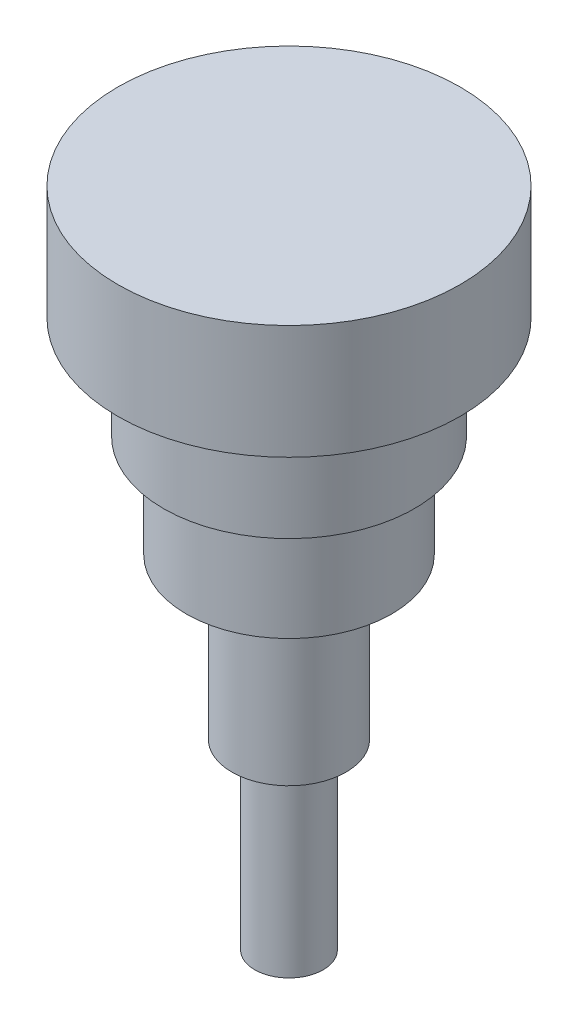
from build123d import *


with BuildPart() as part:
    # Sketch 2 → Revolve 1 (revolve)
    with BuildSketch(Plane.XY, mode=Mode.PRIVATE) as revolve_1_sk:
        Polygon((0, 98), (-3, 98), (-3, 114), (-5, 114), (-5, 128), (-9, 128), (-9, 137), (-11, 137), (-11, 146), (-15, 146), (-15, 156), (0, 156), align=None)
    revolve(revolve_1_sk.sketch.rotate(Axis((0, 128, 0), (0, -1, 0)), 270), axis=Axis((0, 128, 0), (0, -1, 0)))


solid = part.part
